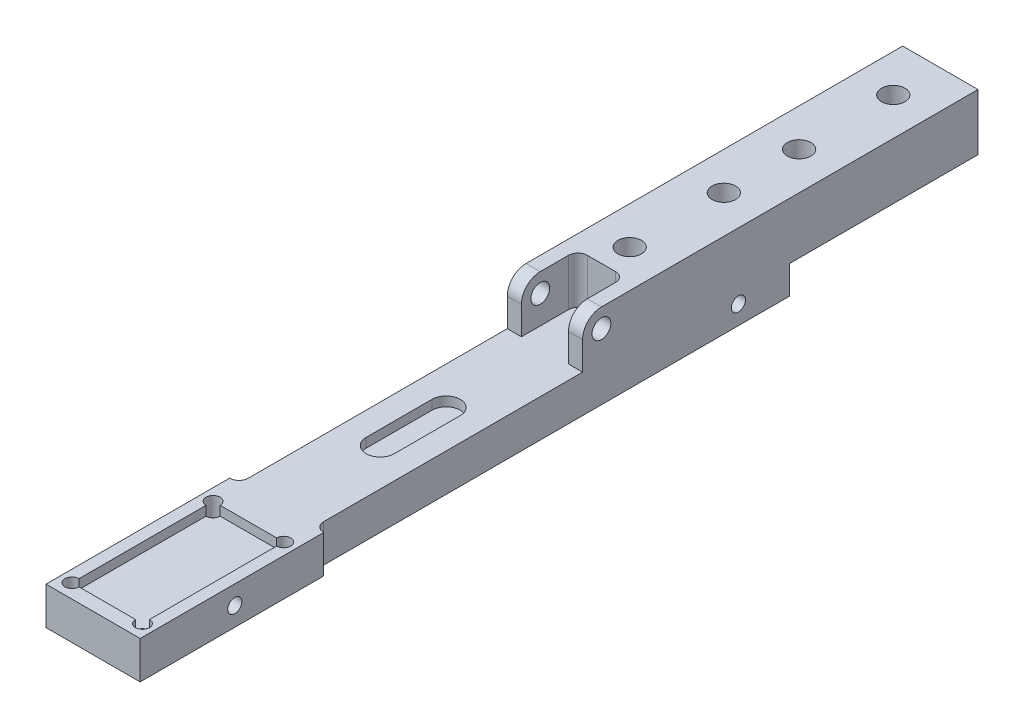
from build123d import *

# Parameters (mm, degrees)
SKETCH1_W               = 140
SKETCH1_H               = 6
BOSS_EXTRUDE1_DEPTH     = 10
SKETCH2_R               = 2
BOSS_EXTRUDE2_DEPTH     = 10
SKETCH6_W               = 2
SKETCH6_H               = 12
CUT_EXTRUDE3_DEPTH      = 98.529482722
CUT_EXTRUDE4_DEPTH      = 10
SKETCH8_W               = 16
SKETCH8_H               = 2
BOSS_EXTRUDE3_DEPTH     = 15
SKETCH9_W               = 20
SKETCH9_H               = 2
BOSS_EXTRUDE4_DEPTH     = 81
CUT_EXTRUDE6_DEPTH      = 102.212647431
CUT_EXTRUDE6_DEPTH_BACK = 102.212647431
SKETCH12_W              = 16
SKETCH12_H              = 12
BOSS_EXTRUDE5_DEPTH     = 40
SKETCH13_R              = 1.5
CUT_EXTRUDE7_DEPTH      = 101.995049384
SKETCH14_W              = 15
SKETCH14_H              = 30
CUT_EXTRUDE8_DEPTH      = 2
CUT_EXTRUDE9_DEPTH      = 2
SKETCH16_R              = 2.5
CUT_EXTRUDE10_DEPTH     = 103.097992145
SKETCH17_R              = 2.5
CUT_EXTRUDE11_DEPTH     = 102.212647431
SKETCH18_R              = 1.5
CUT_EXTRUDE12_DEPTH     = 15
SKETCH19_R              = 1.5
CUT_EXTRUDE13_DEPTH     = 15


with BuildPart() as part:
    # Sketch1 → Boss-Extrude1 (new, symmetric)
    with BuildSketch(Plane(origin=(0, 0, 0), x_dir=(0, 0, -1), z_dir=(1, 0, 0))):
        with Locations((-30, -11)):
            Rectangle(SKETCH1_W, SKETCH1_H)
    extrude(amount=BOSS_EXTRUDE1_DEPTH, both=True)

    # Sketch2 → Boss-Extrude2 (add, symmetric)
    with BuildSketch(Plane(origin=(0, 0, 0), x_dir=(0, 0, -1), z_dir=(1, 0, 0))):
        with BuildLine():
            Line((-4, -8), (4, -8))
            Line((4, -8), (40, -8))
            Line((40, -8), (40, 4))
            Line((40, 4), (0, 4))
            ThreePointArc((0, 4), (-2.828427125, 2.828427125), (-4, 0))
            Line((-4, 0), (-4, -8))
        make_face()
        Circle(SKETCH2_R, mode=Mode.SUBTRACT)
    extrude(amount=BOSS_EXTRUDE2_DEPTH, both=True)

    # Sketch6 → Cut-Extrude3 (cut, through all)
    with BuildSketch(Plane.XY.offset(4)):
        with Locations((-9, -2)):
            Rectangle(SKETCH6_W, SKETCH6_H)
        with Locations((9, -2)):
            Rectangle(SKETCH6_W, SKETCH6_H)
    extrude(amount=-CUT_EXTRUDE3_DEPTH, mode=Mode.SUBTRACT)

    # Sketch7 → Cut-Extrude4 (cut)
    with BuildSketch(Plane(origin=(0, 4, 0), x_dir=(1, 0, 0), z_dir=(0, 1, 0))):
        with BuildLine():
            Line((-5, -4), (5, -4))
            Line((5, -4), (5, 6))
            ThreePointArc((5, 6), (4.414213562, 7.414213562), (3, 8))
            Line((3, 8), (-3, 8))
            ThreePointArc((-3, 8), (-4.414213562, 7.414213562), (-5, 6))
            Line((-5, 6), (-5, -4))
        make_face()
    extrude(amount=-CUT_EXTRUDE4_DEPTH, mode=Mode.SUBTRACT)

    # Sketch8 → Boss-Extrude3 (add)
    with BuildSketch(Plane.XY.offset(4)):
        with Locations((0, -7)):
            Rectangle(SKETCH8_W, SKETCH8_H)
    extrude(amount=BOSS_EXTRUDE3_DEPTH)

    # Sketch9 → Boss-Extrude4 (add)
    with BuildSketch(Plane.XY.offset(19)):
        with Locations((0, -7)):
            Rectangle(SKETCH9_W, SKETCH9_H)
    extrude(amount=BOSS_EXTRUDE4_DEPTH)

    # Sketch11 → Cut-Extrude6 (cut, two sides: drawn at the far end of the back side and taken through both)
    with BuildSketch(Plane(origin=(0, -8, 0), x_dir=(1, 0, 0), z_dir=(0, 1, 0)).offset(-CUT_EXTRUDE6_DEPTH_BACK)):
        with BuildLine():
            Line((-10, -59), (-10, -61))
            ThreePointArc((-10, -61), (-8.585786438, -60.414213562), (-8, -59))
            Line((-8, -59), (-8, 40))
            Line((-8, 40), (-10, 40))
            Line((-10, 40), (-10, -59))
        make_face()
        with BuildLine():
            Line((10, 40), (8, 40))
            Line((8, 40), (8, -59))
            ThreePointArc((8, -59), (8.585786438, -60.414213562), (10, -61))
            Line((10, -61), (10, -59))
            Line((10, -59), (10, 40))
        make_face()
    extrude(amount=CUT_EXTRUDE6_DEPTH + CUT_EXTRUDE6_DEPTH_BACK, mode=Mode.SUBTRACT)

    # Sketch12 → Boss-Extrude5 (add)
    with BuildSketch(Plane(origin=(0, 0, -40), x_dir=(-1, 0, 0), z_dir=(0, 0, -1))):
        with Locations((0, -2)):
            Rectangle(SKETCH12_W, SKETCH12_H)
    extrude(amount=BOSS_EXTRUDE5_DEPTH)

    # Sketch13 → Cut-Extrude7 (cut, through all)
    with BuildSketch(Plane(origin=(0, -6, 0), x_dir=(1, 0, 0), z_dir=(0, 1, 0))):
        with Locations(Location((7.5, -97, 0), (0, 0, 270))):
            Circle(SKETCH13_R)
        with Locations(Location((7.5, -67, 0), (0, 0, 270))):
            Circle(SKETCH13_R)
        with Locations(Location((-7.5, -67, 0), (0, 0, 270))):
            Circle(SKETCH13_R)
        with Locations(Location((-7.5, -97, 0), (0, 0, 270))):
            Circle(SKETCH13_R)
    extrude(amount=-CUT_EXTRUDE7_DEPTH, mode=Mode.SUBTRACT)

    # Sketch14 → Cut-Extrude8 (cut)
    with BuildSketch(Plane(origin=(0, -6, 0), x_dir=(1, 0, 0), z_dir=(0, 1, 0))):
        with Locations((0, -82)):
            Rectangle(SKETCH14_W, SKETCH14_H)
    extrude(amount=-CUT_EXTRUDE8_DEPTH, mode=Mode.SUBTRACT)

    # Sketch15 → Cut-Extrude9 (cut)
    with BuildSketch(Plane(origin=(0, -6, 0), x_dir=(1, 0, 0), z_dir=(0, 1, 0))):
        with BuildLine():
            Line((3, -25), (3, -39))
            ThreePointArc((3, -39), (0, -42), (-3, -39))
            Line((-3, -39), (-3, -25))
            ThreePointArc((-3, -25), (0, -22), (3, -25))
        make_face()
    extrude(amount=-CUT_EXTRUDE9_DEPTH, mode=Mode.SUBTRACT)

    # Sketch16 → Cut-Extrude10 (cut, through all)
    with BuildSketch(Plane.XZ.offset(14)):
        with Locations(Location((0, -34, 0), (0, 0, 270))):
            Circle(SKETCH16_R)
        with Locations(Location((0, -14, 0), (0, 0, 270))):
            Circle(SKETCH16_R)
    extrude(amount=-CUT_EXTRUDE10_DEPTH, mode=Mode.SUBTRACT)

    # Sketch17 → Cut-Extrude11 (cut, through all)
    with BuildSketch(Plane.XZ.offset(8)):
        with Locations((0, -70)):
            Circle(SKETCH17_R)
        with Locations((0, -50)):
            Circle(SKETCH17_R)
    extrude(amount=-CUT_EXTRUDE11_DEPTH, mode=Mode.SUBTRACT)

    # Sketch18 → Cut-Extrude12 (cut)
    with BuildSketch(Plane(origin=(8, 0, 0), x_dir=(0, 0, -1), z_dir=(1, 0, 0))):
        with Locations((29.1, -10)):
            Circle(SKETCH18_R)
    extrude(amount=-CUT_EXTRUDE12_DEPTH, mode=Mode.SUBTRACT)

    # Sketch19 → Cut-Extrude13 (cut)
    with BuildSketch(Plane(origin=(10, 0, 0), x_dir=(0, 0, -1), z_dir=(1, 0, 0))):
        with Locations((-79.9, -10)):
            Circle(SKETCH19_R)
    extrude(amount=-CUT_EXTRUDE13_DEPTH, mode=Mode.SUBTRACT)


solid = part.part
